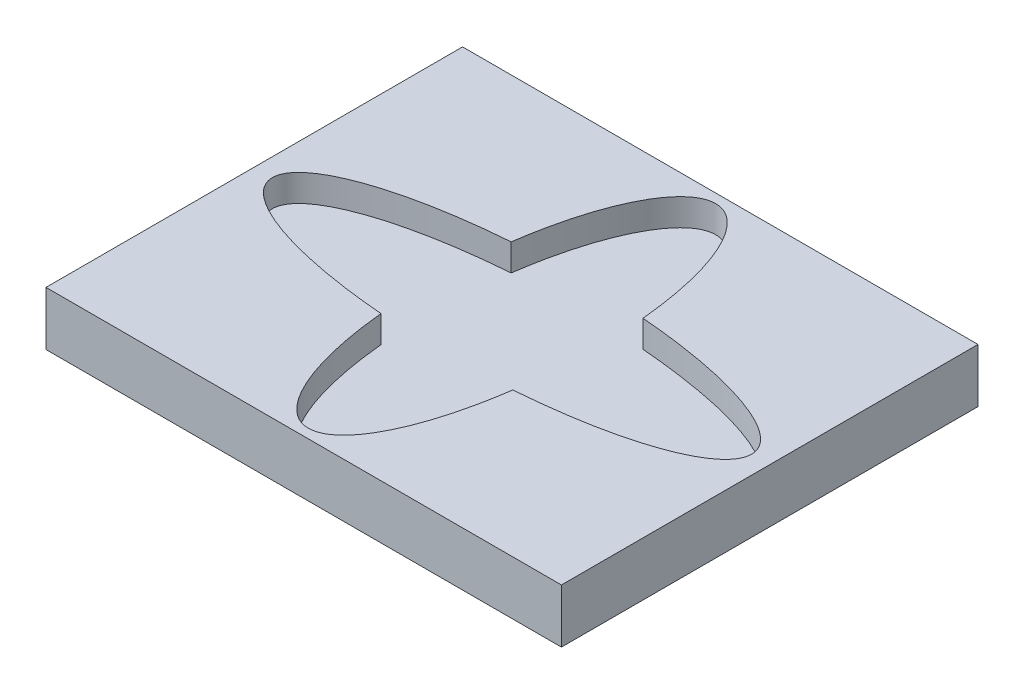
from build123d import *

# Parameters (mm, degrees)
SKETCH1_W           = 191.427557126
SKETCH1_H           = 154.719147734
BOSS_EXTRUDE1_DEPTH = 20
CUT_EXTRUDE1_DEPTH  = 10


with BuildPart() as part:
    # Sketch1 → Boss-Extrude1 (new body)
    with BuildSketch(Plane(origin=(0, 0, 0), x_dir=(1, 0, 0), z_dir=(0, 1, 0))):
        Rectangle(SKETCH1_W, SKETCH1_H)
    extrude(amount=BOSS_EXTRUDE1_DEPTH)

    # Sketch2 → Cut-Extrude1 (cut)
    with BuildSketch(Plane(origin=(0, 20, 0), x_dir=(1, 0, 0), z_dir=(0, 1, 0))):
        with BuildLine():
            add(Edge.make_bspline(
                [(-23.968670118, 23.665823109), (-322.926444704, 0.574955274), (-25.071661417, -23.578509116)],
                knots=[4.985109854, 4.985109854, 4.985109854, 7.568366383, 7.568366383, 7.568366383], degree=2, weights=[1, 0.275556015, 1]))
            add(Edge.make_bspline(
                [(-25.071661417, -23.578509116), (-5.403587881, -231.451418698), (23.968670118, -23.665823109)],
                knots=[1.904560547, 1.904560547, 1.904560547, 4.395813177, 4.395813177, 4.395813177], degree=2, weights=[1, 0.319469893, 1]))
            add(Edge.make_bspline(
                [(23.968670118, -23.665823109), (322.926444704, -0.574955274), (25.071661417, 23.578509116)],
                knots=[1.8435172, 1.8435172, 1.8435172, 4.426773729, 4.426773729, 4.426773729], degree=2, weights=[1, 0.275556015, 1]))
            add(Edge.make_bspline(
                [(25.071661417, 23.578509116), (5.403587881, 231.451418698), (-23.968670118, 23.665823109)],
                knots=[5.0461532, 5.0461532, 5.0461532, 7.537405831, 7.537405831, 7.537405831], degree=2, weights=[1, 0.319469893, 1]))
        make_face()
    extrude(amount=-CUT_EXTRUDE1_DEPTH, mode=Mode.SUBTRACT)


solid = part.part
